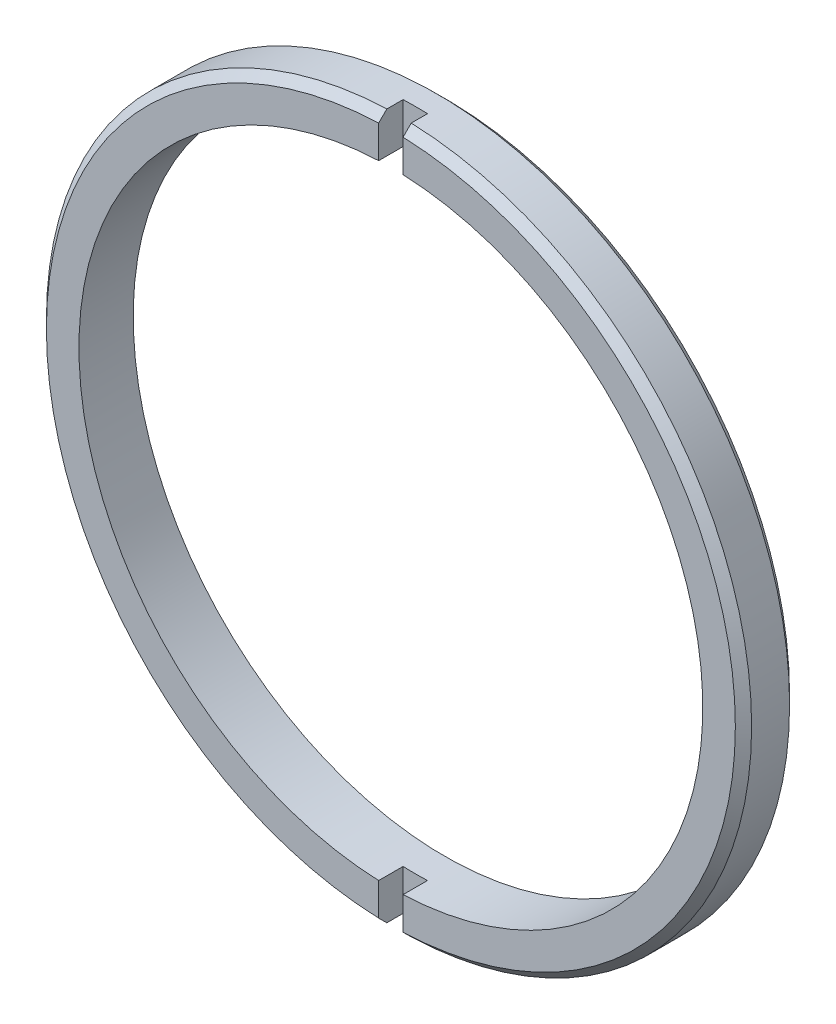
ISO-10303-21;
HEADER;
FILE_DESCRIPTION(('STEP AP214'),'2;1');
FILE_NAME('part.step','',(''),(''),'','','');
FILE_SCHEMA(('AUTOMOTIVE_DESIGN { 1 0 10303 214 1 1 1 1 }'));
ENDSEC;
DATA;
#1=APPLICATION_CONTEXT('core data for automotive mechanical design processes');
#2=APPLICATION_PROTOCOL_DEFINITION('international standard','automotive_design',2000,#1);
#3=PRODUCT_CONTEXT('',#1,'mechanical');
#4=PRODUCT('Part','Part','',(#3));
#5=PRODUCT_RELATED_PRODUCT_CATEGORY('part','',(#4));
#6=PRODUCT_DEFINITION_FORMATION('','',#4);
#7=PRODUCT_DEFINITION_CONTEXT('part definition',#1,'design');
#8=PRODUCT_DEFINITION('design','',#6,#7);
#9=PRODUCT_DEFINITION_SHAPE('','',#8);
#10=(LENGTH_UNIT() NAMED_UNIT(*) SI_UNIT(.MILLI.,.METRE.));
#11=(NAMED_UNIT(*) PLANE_ANGLE_UNIT() SI_UNIT($,.RADIAN.));
#12=(NAMED_UNIT(*) SI_UNIT($,.STERADIAN.) SOLID_ANGLE_UNIT());
#13=UNCERTAINTY_MEASURE_WITH_UNIT(LENGTH_MEASURE(1.E-05),#10,'distance_accuracy_value','');
#14=(GEOMETRIC_REPRESENTATION_CONTEXT(3) GLOBAL_UNCERTAINTY_ASSIGNED_CONTEXT((#13)) GLOBAL_UNIT_ASSIGNED_CONTEXT((#10,
#11,#12)) REPRESENTATION_CONTEXT('',''));
#15=CARTESIAN_POINT('',(0.,0.,0.));
#16=DIRECTION('',(0.,0.,1.));
#17=DIRECTION('',(1.,0.,0.));
#18=AXIS2_PLACEMENT_3D('',#15,#16,#17);
#19=CARTESIAN_POINT('',(0.,0.,2.));
#20=DIRECTION('',(0.,0.,1.));
#21=DIRECTION('',(1.,0.,0.));
#22=AXIS2_PLACEMENT_3D('',#19,#20,#21);
#23=PLANE('',#22);
#24=DIRECTION('',(0.,1.,0.));
#25=VECTOR('',#24,1.);
#26=CARTESIAN_POINT('',(0.45,-13.,2.));
#27=LINE('',#26,#25);
#28=CARTESIAN_POINT('',(0.45,-12.6920250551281,2.));
#29=VERTEX_POINT('',#28);
#30=CARTESIAN_POINT('',(0.45,-11.4911922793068,2.));
#31=VERTEX_POINT('',#30);
#32=EDGE_CURVE('E138',#29,#31,#27,.T.);
#33=ORIENTED_EDGE('',*,*,#32,.F.);
#34=CARTESIAN_POINT('',(0.,0.,2.));
#35=DIRECTION('',(0.,0.,1.));
#36=DIRECTION('',(1.,0.,0.));
#37=AXIS2_PLACEMENT_3D('',#34,#35,#36);
#38=CIRCLE('',#37,12.7);
#39=CARTESIAN_POINT('',(0.45,12.6920250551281,2.));
#40=VERTEX_POINT('',#39);
#41=EDGE_CURVE('E204',#29,#40,#38,.T.);
#42=ORIENTED_EDGE('',*,*,#41,.T.);
#43=CARTESIAN_POINT('',(0.45,11.4911922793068,2.));
#44=VERTEX_POINT('',#43);
#45=EDGE_CURVE('E310',#44,#40,#27,.T.);
#46=ORIENTED_EDGE('',*,*,#45,.F.);
#47=CARTESIAN_POINT('',(0.,0.,2.));
#48=DIRECTION('',(0.,0.,1.));
#49=DIRECTION('',(1.,0.,0.));
#50=AXIS2_PLACEMENT_3D('',#47,#48,#49);
#51=CIRCLE('',#50,11.5);
#52=EDGE_CURVE('E179',#31,#44,#51,.T.);
#53=ORIENTED_EDGE('',*,*,#52,.F.);
#54=EDGE_LOOP('',(#33,#42,#46,#53));
#55=FACE_BOUND('',#54,.T.);
#56=ADVANCED_FACE('F46',(#55),#23,.T.);
#57=DIRECTION('',(0.,1.,0.));
#58=VECTOR('',#57,1.);
#59=CARTESIAN_POINT('',(-0.45,-13.,2.));
#60=LINE('',#59,#58);
#61=CARTESIAN_POINT('',(-0.45,11.4911922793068,2.));
#62=VERTEX_POINT('',#61);
#63=CARTESIAN_POINT('',(-0.45,12.6920250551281,2.));
#64=VERTEX_POINT('',#63);
#65=EDGE_CURVE('E154',#62,#64,#60,.T.);
#66=ORIENTED_EDGE('',*,*,#65,.T.);
#67=CARTESIAN_POINT('',(0.,0.,2.));
#68=DIRECTION('',(0.,0.,1.));
#69=DIRECTION('',(1.,0.,0.));
#70=AXIS2_PLACEMENT_3D('',#67,#68,#69);
#71=CIRCLE('',#70,12.7);
#72=CARTESIAN_POINT('',(-0.45,-12.6920250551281,2.));
#73=VERTEX_POINT('',#72);
#74=EDGE_CURVE('E244',#64,#73,#71,.T.);
#75=ORIENTED_EDGE('',*,*,#74,.T.);
#76=CARTESIAN_POINT('',(-0.45,-11.4911922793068,2.));
#77=VERTEX_POINT('',#76);
#78=EDGE_CURVE('E160',#73,#77,#60,.T.);
#79=ORIENTED_EDGE('',*,*,#78,.T.);
#80=EDGE_CURVE('E183',#62,#77,#51,.T.);
#81=ORIENTED_EDGE('',*,*,#80,.F.);
#82=EDGE_LOOP('',(#66,#75,#79,#81));
#83=FACE_BOUND('',#82,.T.);
#84=ADVANCED_FACE('F272',(#83),#23,.T.);
#85=CARTESIAN_POINT('',(0.,0.,0.));
#86=DIRECTION('',(0.,0.,1.));
#87=DIRECTION('',(1.,0.,0.));
#88=AXIS2_PLACEMENT_3D('',#85,#86,#87);
#89=PLANE('',#88);
#90=CARTESIAN_POINT('',(0.,0.,0.));
#91=DIRECTION('',(0.,0.,1.));
#92=DIRECTION('',(1.,0.,0.));
#93=AXIS2_PLACEMENT_3D('',#90,#91,#92);
#94=CIRCLE('',#93,12.7);
#95=CARTESIAN_POINT('',(12.7,0.,0.));
#96=VERTEX_POINT('',#95);
#97=EDGE_CURVE('E11',#96,#96,#94,.F.);
#98=ORIENTED_EDGE('',*,*,#97,.T.);
#99=EDGE_LOOP('',(#98));
#100=FACE_BOUND('',#99,.T.);
#101=CARTESIAN_POINT('',(0.,0.,0.));
#102=DIRECTION('',(0.,0.,1.));
#103=DIRECTION('',(1.,0.,0.));
#104=AXIS2_PLACEMENT_3D('',#101,#102,#103);
#105=CIRCLE('',#104,11.5);
#106=CARTESIAN_POINT('',(11.5,0.,0.));
#107=VERTEX_POINT('',#106);
#108=EDGE_CURVE('E178',#107,#107,#105,.T.);
#109=ORIENTED_EDGE('',*,*,#108,.T.);
#110=EDGE_LOOP('',(#109));
#111=FACE_BOUND('',#110,.T.);
#112=ADVANCED_FACE('F277',(#100,#111),#89,.F.);
#113=CARTESIAN_POINT('',(0.,0.,2.));
#114=DIRECTION('',(0.,0.,-1.));
#115=DIRECTION('',(-1.,0.,0.));
#116=AXIS2_PLACEMENT_3D('',#113,#114,#115);
#117=CYLINDRICAL_SURFACE('',#116,13.);
#118=CARTESIAN_POINT('',(0.,0.,0.300000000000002));
#119=DIRECTION('',(0.,0.,1.));
#120=DIRECTION('',(1.,0.,0.));
#121=AXIS2_PLACEMENT_3D('',#118,#119,#120);
#122=CIRCLE('',#121,13.);
#123=CARTESIAN_POINT('',(13.,0.,0.300000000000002));
#124=VERTEX_POINT('',#123);
#125=EDGE_CURVE('E217',#124,#124,#122,.T.);
#126=ORIENTED_EDGE('',*,*,#125,.T.);
#127=EDGE_LOOP('',(#126));
#128=FACE_BOUND('',#127,.T.);
#129=DIRECTION('',(0.,0.,-1.));
#130=VECTOR('',#129,1.);
#131=CARTESIAN_POINT('',(0.45,12.9922092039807,2.));
#132=LINE('',#131,#130);
#133=CARTESIAN_POINT('',(0.45,12.9922092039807,1.1));
#134=VERTEX_POINT('',#133);
#135=CARTESIAN_POINT('',(0.45,12.9922092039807,1.69999999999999));
#136=VERTEX_POINT('',#135);
#137=EDGE_CURVE('E173',#134,#136,#132,.F.);
#138=ORIENTED_EDGE('',*,*,#137,.T.);
#139=CARTESIAN_POINT('',(0.,0.,1.69999999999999));
#140=DIRECTION('',(0.,0.,1.));
#141=DIRECTION('',(1.,0.,0.));
#142=AXIS2_PLACEMENT_3D('',#139,#140,#141);
#143=CIRCLE('',#142,13.);
#144=CARTESIAN_POINT('',(0.45,-12.9922092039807,1.69999999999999));
#145=VERTEX_POINT('',#144);
#146=EDGE_CURVE('E245',#136,#145,#143,.F.);
#147=ORIENTED_EDGE('',*,*,#146,.T.);
#148=DIRECTION('',(0.,0.,-1.));
#149=VECTOR('',#148,1.);
#150=CARTESIAN_POINT('',(0.45,-12.9922092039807,2.));
#151=LINE('',#150,#149);
#152=CARTESIAN_POINT('',(0.45,-12.9922092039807,1.1));
#153=VERTEX_POINT('',#152);
#154=EDGE_CURVE('E132',#145,#153,#151,.T.);
#155=ORIENTED_EDGE('',*,*,#154,.T.);
#156=CARTESIAN_POINT('',(0.,0.,1.1));
#157=DIRECTION('',(0.,0.,-1.));
#158=DIRECTION('',(-1.,0.,0.));
#159=AXIS2_PLACEMENT_3D('',#156,#157,#158);
#160=CIRCLE('',#159,13.);
#161=CARTESIAN_POINT('',(-0.45,-12.9922092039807,1.1));
#162=VERTEX_POINT('',#161);
#163=EDGE_CURVE('E126',#153,#162,#160,.T.);
#164=ORIENTED_EDGE('',*,*,#163,.T.);
#165=DIRECTION('',(0.,0.,-1.));
#166=VECTOR('',#165,1.);
#167=CARTESIAN_POINT('',(-0.45,-12.9922092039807,2.));
#168=LINE('',#167,#166);
#169=CARTESIAN_POINT('',(-0.45,-12.9922092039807,1.69999999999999));
#170=VERTEX_POINT('',#169);
#171=EDGE_CURVE('E130',#162,#170,#168,.F.);
#172=ORIENTED_EDGE('',*,*,#171,.T.);
#173=CARTESIAN_POINT('',(0.,0.,1.69999999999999));
#174=DIRECTION('',(0.,0.,1.));
#175=DIRECTION('',(1.,0.,0.));
#176=AXIS2_PLACEMENT_3D('',#173,#174,#175);
#177=CIRCLE('',#176,13.);
#178=CARTESIAN_POINT('',(-0.45,12.9922092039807,1.69999999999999));
#179=VERTEX_POINT('',#178);
#180=EDGE_CURVE('E293',#170,#179,#177,.F.);
#181=ORIENTED_EDGE('',*,*,#180,.T.);
#182=DIRECTION('',(0.,0.,-1.));
#183=VECTOR('',#182,1.);
#184=CARTESIAN_POINT('',(-0.45,12.9922092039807,2.));
#185=LINE('',#184,#183);
#186=CARTESIAN_POINT('',(-0.45,12.9922092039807,1.1));
#187=VERTEX_POINT('',#186);
#188=EDGE_CURVE('E148',#179,#187,#185,.T.);
#189=ORIENTED_EDGE('',*,*,#188,.T.);
#190=EDGE_CURVE('E137',#187,#134,#160,.T.);
#191=ORIENTED_EDGE('',*,*,#190,.T.);
#192=EDGE_LOOP('',(#138,#147,#155,#164,#172,#181,#189,#191));
#193=FACE_BOUND('',#192,.T.);
#194=ADVANCED_FACE('F129',(#128,#193),#117,.T.);
#195=CARTESIAN_POINT('',(0.,0.,2.));
#196=DIRECTION('',(0.,0.,-1.));
#197=DIRECTION('',(-1.,0.,0.));
#198=AXIS2_PLACEMENT_3D('',#195,#196,#197);
#199=CYLINDRICAL_SURFACE('',#198,11.5);
#200=DIRECTION('',(0.,0.,-1.));
#201=VECTOR('',#200,1.);
#202=CARTESIAN_POINT('',(0.45,11.4911922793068,2.));
#203=LINE('',#202,#201);
#204=CARTESIAN_POINT('',(0.45,11.4911922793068,1.1));
#205=VERTEX_POINT('',#204);
#206=EDGE_CURVE('E201',#205,#44,#203,.F.);
#207=ORIENTED_EDGE('',*,*,#206,.F.);
#208=CARTESIAN_POINT('',(0.,0.,1.1));
#209=DIRECTION('',(0.,0.,-1.));
#210=DIRECTION('',(-1.,0.,0.));
#211=AXIS2_PLACEMENT_3D('',#208,#209,#210);
#212=CIRCLE('',#211,11.5);
#213=CARTESIAN_POINT('',(-0.45,11.4911922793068,1.1));
#214=VERTEX_POINT('',#213);
#215=EDGE_CURVE('E190',#214,#205,#212,.T.);
#216=ORIENTED_EDGE('',*,*,#215,.F.);
#217=DIRECTION('',(0.,0.,-1.));
#218=VECTOR('',#217,1.);
#219=CARTESIAN_POINT('',(-0.45,11.4911922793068,2.));
#220=LINE('',#219,#218);
#221=EDGE_CURVE('E197',#62,#214,#220,.T.);
#222=ORIENTED_EDGE('',*,*,#221,.F.);
#223=ORIENTED_EDGE('',*,*,#80,.T.);
#224=DIRECTION('',(0.,0.,-1.));
#225=VECTOR('',#224,1.);
#226=CARTESIAN_POINT('',(-0.45,-11.4911922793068,2.));
#227=LINE('',#226,#225);
#228=CARTESIAN_POINT('',(-0.45,-11.4911922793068,1.1));
#229=VERTEX_POINT('',#228);
#230=EDGE_CURVE('E189',#229,#77,#227,.F.);
#231=ORIENTED_EDGE('',*,*,#230,.F.);
#232=CARTESIAN_POINT('',(0.45,-11.4911922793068,1.1));
#233=VERTEX_POINT('',#232);
#234=EDGE_CURVE('E152',#233,#229,#212,.T.);
#235=ORIENTED_EDGE('',*,*,#234,.F.);
#236=DIRECTION('',(0.,0.,-1.));
#237=VECTOR('',#236,1.);
#238=CARTESIAN_POINT('',(0.45,-11.4911922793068,2.));
#239=LINE('',#238,#237);
#240=EDGE_CURVE('E193',#31,#233,#239,.T.);
#241=ORIENTED_EDGE('',*,*,#240,.F.);
#242=ORIENTED_EDGE('',*,*,#52,.T.);
#243=EDGE_LOOP('',(#207,#216,#222,#223,#231,#235,#241,#242));
#244=FACE_BOUND('',#243,.T.);
#245=ORIENTED_EDGE('',*,*,#108,.F.);
#246=EDGE_LOOP('',(#245));
#247=FACE_BOUND('',#246,.T.);
#248=ADVANCED_FACE('F232',(#244,#247),#199,.F.);
#249=CARTESIAN_POINT('',(0.45,-13.,1.1));
#250=DIRECTION('',(0.,0.,-1.));
#251=DIRECTION('',(-1.,0.,0.));
#252=AXIS2_PLACEMENT_3D('',#249,#250,#251);
#253=PLANE('',#252);
#254=DIRECTION('',(0.,1.,0.));
#255=VECTOR('',#254,1.);
#256=CARTESIAN_POINT('',(0.45,-13.,1.1));
#257=LINE('',#256,#255);
#258=EDGE_CURVE('E163',#153,#233,#257,.T.);
#259=ORIENTED_EDGE('',*,*,#258,.T.);
#260=ORIENTED_EDGE('',*,*,#234,.T.);
#261=DIRECTION('',(0.,1.,0.));
#262=VECTOR('',#261,1.);
#263=CARTESIAN_POINT('',(-0.45,-13.,1.1));
#264=LINE('',#263,#262);
#265=EDGE_CURVE('E145',#162,#229,#264,.T.);
#266=ORIENTED_EDGE('',*,*,#265,.F.);
#267=ORIENTED_EDGE('',*,*,#163,.F.);
#268=EDGE_LOOP('',(#259,#260,#266,#267));
#269=FACE_BOUND('',#268,.T.);
#270=ADVANCED_FACE('F150',(#269),#253,.F.);
#271=CARTESIAN_POINT('',(-0.45,-13.,2.));
#272=DIRECTION('',(-1.,0.,0.));
#273=DIRECTION('',(0.,0.,1.));
#274=AXIS2_PLACEMENT_3D('',#271,#272,#273);
#275=PLANE('',#274);
#276=ORIENTED_EDGE('',*,*,#78,.F.);
#277=CARTESIAN_POINT('',(-0.45,-12.6920250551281,2.));
#278=CARTESIAN_POINT('',(-0.45,-12.7420561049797,1.95000035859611));
#279=CARTESIAN_POINT('',(-0.45,-12.7920869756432,1.90000053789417));
#280=CARTESIAN_POINT('',(-0.45,-12.892148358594,1.80000053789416));
#281=CARTESIAN_POINT('',(-0.45,-12.9421788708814,1.75000035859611));
#282=CARTESIAN_POINT('',(-0.45,-12.9922092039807,1.69999999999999));
#283=B_SPLINE_CURVE_WITH_KNOTS('',3,(#277,#278,#279,#280,#281,#282),.UNSPECIFIED.,.F.,.F.,(4,2,
4),(0.,0.212197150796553,0.424394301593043),.UNSPECIFIED.);
#284=EDGE_CURVE('E63',#73,#170,#283,.T.);
#285=ORIENTED_EDGE('',*,*,#284,.T.);
#286=ORIENTED_EDGE('',*,*,#171,.F.);
#287=ORIENTED_EDGE('',*,*,#265,.T.);
#288=ORIENTED_EDGE('',*,*,#230,.T.);
#289=EDGE_LOOP('',(#276,#285,#286,#287,#288));
#290=FACE_BOUND('',#289,.T.);
#291=ADVANCED_FACE('F143',(#290),#275,.F.);
#292=CARTESIAN_POINT('',(0.45,-13.,2.));
#293=DIRECTION('',(1.,0.,0.));
#294=DIRECTION('',(0.,0.,-1.));
#295=AXIS2_PLACEMENT_3D('',#292,#293,#294);
#296=PLANE('',#295);
#297=ORIENTED_EDGE('',*,*,#154,.F.);
#298=CARTESIAN_POINT('',(0.45,-12.9922092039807,1.69999999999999));
#299=CARTESIAN_POINT('',(0.45,-12.9421788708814,1.75000035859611));
#300=CARTESIAN_POINT('',(0.45,-12.892148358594,1.80000053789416));
#301=CARTESIAN_POINT('',(0.45,-12.7920869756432,1.90000053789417));
#302=CARTESIAN_POINT('',(0.45,-12.7420561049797,1.95000035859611));
#303=CARTESIAN_POINT('',(0.45,-12.6920250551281,2.));
#304=B_SPLINE_CURVE_WITH_KNOTS('',3,(#298,#299,#300,#301,#302,#303),.UNSPECIFIED.,.F.,.F.,(4,2,
4),(0.,0.212197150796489,0.424394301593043),.UNSPECIFIED.);
#305=EDGE_CURVE('E236',#145,#29,#304,.T.);
#306=ORIENTED_EDGE('',*,*,#305,.T.);
#307=ORIENTED_EDGE('',*,*,#32,.T.);
#308=ORIENTED_EDGE('',*,*,#240,.T.);
#309=ORIENTED_EDGE('',*,*,#258,.F.);
#310=EDGE_LOOP('',(#297,#306,#307,#308,#309));
#311=FACE_BOUND('',#310,.T.);
#312=ADVANCED_FACE('F223',(#311),#296,.F.);
#313=ORIENTED_EDGE('',*,*,#45,.T.);
#314=CARTESIAN_POINT('',(0.45,12.6920250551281,2.));
#315=CARTESIAN_POINT('',(0.45,12.7420561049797,1.95000035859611));
#316=CARTESIAN_POINT('',(0.45,12.7920869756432,1.90000053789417));
#317=CARTESIAN_POINT('',(0.45,12.892148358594,1.80000053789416));
#318=CARTESIAN_POINT('',(0.45,12.9421788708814,1.75000035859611));
#319=CARTESIAN_POINT('',(0.45,12.9922092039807,1.69999999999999));
#320=B_SPLINE_CURVE_WITH_KNOTS('',3,(#314,#315,#316,#317,#318,#319),.UNSPECIFIED.,.F.,.F.,(4,2,
4),(0.,0.212197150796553,0.424394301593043),.UNSPECIFIED.);
#321=EDGE_CURVE('E208',#40,#136,#320,.T.);
#322=ORIENTED_EDGE('',*,*,#321,.T.);
#323=ORIENTED_EDGE('',*,*,#137,.F.);
#324=EDGE_CURVE('E166',#205,#134,#257,.T.);
#325=ORIENTED_EDGE('',*,*,#324,.F.);
#326=ORIENTED_EDGE('',*,*,#206,.T.);
#327=EDGE_LOOP('',(#313,#322,#323,#325,#326));
#328=FACE_BOUND('',#327,.T.);
#329=ADVANCED_FACE('F228',(#328),#296,.F.);
#330=ORIENTED_EDGE('',*,*,#188,.F.);
#331=CARTESIAN_POINT('',(-0.45,12.9922092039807,1.69999999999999));
#332=CARTESIAN_POINT('',(-0.45,12.9421788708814,1.75000035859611));
#333=CARTESIAN_POINT('',(-0.45,12.892148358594,1.80000053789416));
#334=CARTESIAN_POINT('',(-0.45,12.7920869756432,1.90000053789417));
#335=CARTESIAN_POINT('',(-0.45,12.7420561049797,1.95000035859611));
#336=CARTESIAN_POINT('',(-0.45,12.6920250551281,2.));
#337=B_SPLINE_CURVE_WITH_KNOTS('',3,(#331,#332,#333,#334,#335,#336),.UNSPECIFIED.,.F.,.F.,(4,2,
4),(0.,0.212197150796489,0.424394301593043),.UNSPECIFIED.);
#338=EDGE_CURVE('E56',#179,#64,#337,.T.);
#339=ORIENTED_EDGE('',*,*,#338,.T.);
#340=ORIENTED_EDGE('',*,*,#65,.F.);
#341=ORIENTED_EDGE('',*,*,#221,.T.);
#342=EDGE_CURVE('E155',#214,#187,#264,.T.);
#343=ORIENTED_EDGE('',*,*,#342,.T.);
#344=EDGE_LOOP('',(#330,#339,#340,#341,#343));
#345=FACE_BOUND('',#344,.T.);
#346=ADVANCED_FACE('F260',(#345),#275,.F.);
#347=ORIENTED_EDGE('',*,*,#342,.F.);
#348=ORIENTED_EDGE('',*,*,#215,.T.);
#349=ORIENTED_EDGE('',*,*,#324,.T.);
#350=ORIENTED_EDGE('',*,*,#190,.F.);
#351=EDGE_LOOP('',(#347,#348,#349,#350));
#352=FACE_BOUND('',#351,.T.);
#353=ADVANCED_FACE('F230',(#352),#253,.F.);
#354=CARTESIAN_POINT('',(0.,0.,2.));
#355=DIRECTION('',(0.,0.,-1.));
#356=DIRECTION('',(-1.,0.,0.));
#357=AXIS2_PLACEMENT_3D('',#354,#355,#356);
#358=CONICAL_SURFACE('',#357,12.7,0.785398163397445);
#359=ORIENTED_EDGE('',*,*,#305,.F.);
#360=ORIENTED_EDGE('',*,*,#146,.F.);
#361=ORIENTED_EDGE('',*,*,#321,.F.);
#362=ORIENTED_EDGE('',*,*,#41,.F.);
#363=EDGE_LOOP('',(#359,#360,#361,#362));
#364=FACE_BOUND('',#363,.T.);
#365=ADVANCED_FACE('F220',(#364),#358,.T.);
#366=CARTESIAN_POINT('',(0.,0.,2.));
#367=DIRECTION('',(0.,0.,-1.));
#368=DIRECTION('',(-1.,0.,0.));
#369=AXIS2_PLACEMENT_3D('',#366,#367,#368);
#370=CONICAL_SURFACE('',#369,12.7,0.785398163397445);
#371=ORIENTED_EDGE('',*,*,#338,.F.);
#372=ORIENTED_EDGE('',*,*,#180,.F.);
#373=ORIENTED_EDGE('',*,*,#284,.F.);
#374=ORIENTED_EDGE('',*,*,#74,.F.);
#375=EDGE_LOOP('',(#371,#372,#373,#374));
#376=FACE_BOUND('',#375,.T.);
#377=ADVANCED_FACE('F258',(#376),#370,.T.);
#378=CARTESIAN_POINT('',(0.,0.,0.300000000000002));
#379=DIRECTION('',(0.,0.,1.));
#380=DIRECTION('',(1.,0.,0.));
#381=AXIS2_PLACEMENT_3D('',#378,#379,#380);
#382=CONICAL_SURFACE('',#381,13.,0.785398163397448);
#383=ORIENTED_EDGE('',*,*,#97,.F.);
#384=EDGE_LOOP('',(#383));
#385=FACE_BOUND('',#384,.T.);
#386=ORIENTED_EDGE('',*,*,#125,.F.);
#387=EDGE_LOOP('',(#386));
#388=FACE_BOUND('',#387,.T.);
#389=ADVANCED_FACE('F49',(#385,#388),#382,.T.);
#390=CLOSED_SHELL('',(#56,#84,#112,#194,#248,#270,#291,#312,#329,#346,#353,#365,#377,#389));
#391=MANIFOLD_SOLID_BREP('B2',#390);
#392=ADVANCED_BREP_SHAPE_REPRESENTATION('',(#18,#391),#14);
#393=SHAPE_DEFINITION_REPRESENTATION(#9,#392);
ENDSEC;
END-ISO-10303-21;
